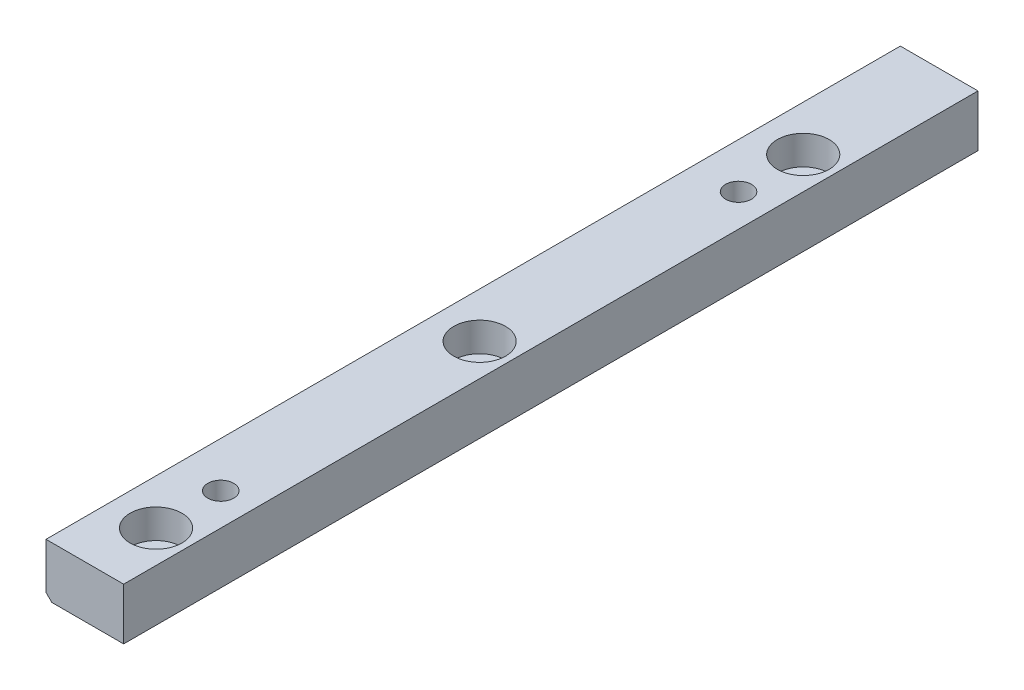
from build123d import *

# Parameters (mm, degrees)
EXTRUDE_1_DEPTH     = 132
SKETCH_2_R          = 2.25
SKETCH_2_R_2        = 2
CUT_EXTRUDE_1_DEPTH = 132
SKETCH_3_R          = 4
CUT_EXTRUDE_2_DEPTH = 4.5


with BuildPart() as part:
    # Sketch 1 → Extrude 1 (new body)
    with BuildSketch(Plane.XY):
        Polygon((0, 0.9), (0, 8), (12, 8), (12, 0), (0.9, 0), align=None)
    extrude(amount=EXTRUDE_1_DEPTH)

    # Sketch 2 → Cut-Extrude 1 (cut)
    with BuildSketch(Plane(origin=(0, 8, 0), x_dir=(1, 0, 0), z_dir=(0, 1, 0))):
        with Locations(Location((7, -22, 0), (0, 0, 270))):
            Circle(SKETCH_2_R)
        with Locations(Location((7, -72, 0), (0, 0, 270))):
            Circle(SKETCH_2_R)
        with Locations(Location((7, -122, 0), (0, 0, 270))):
            Circle(SKETCH_2_R)
        with Locations(Location((7, -32, 0), (0, 0, 270))):
            Circle(SKETCH_2_R_2)
        with Locations(Location((7, -112, 0), (0, 0, 270))):
            Circle(SKETCH_2_R_2)
    extrude(amount=-CUT_EXTRUDE_1_DEPTH, mode=Mode.SUBTRACT)

    # Sketch 3 → Cut-Extrude 2 (cut)
    with BuildSketch(Plane(origin=(0, 8, 0), x_dir=(1, 0, 0), z_dir=(0, 1, 0))):
        with Locations(Location((7, -22, 0), (0, 0, 270))):
            Circle(SKETCH_3_R)
        with Locations(Location((7, -72, 0), (0, 0, 270))):
            Circle(SKETCH_3_R)
        with Locations(Location((7, -122, 0), (0, 0, 270))):
            Circle(SKETCH_3_R)
    extrude(amount=-CUT_EXTRUDE_2_DEPTH, mode=Mode.SUBTRACT)


solid = part.part
